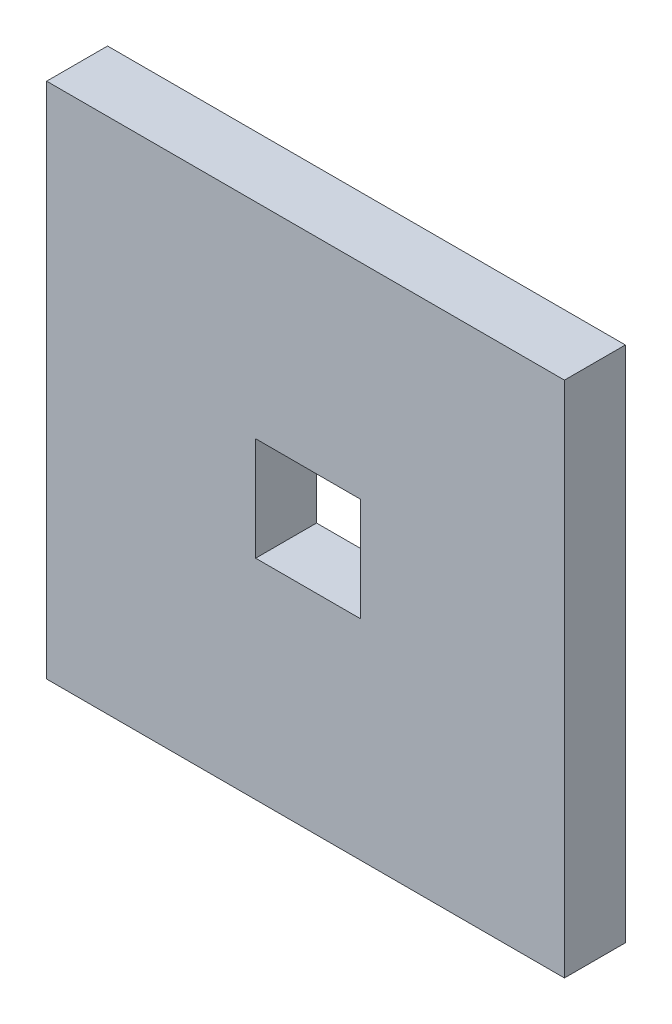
from build123d import *

# Parameters (mm, degrees)
SCHIZZO1_W                        = 60
SCHIZZO1_H                        = 60
SCHIZZO1_W_2                      = 21.49
SCHIZZO1_H_2                      = 21.490369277
ESTRUSIONE_ESTRUSIONE1_DEPTH      = 3
ESTRUSIONE_ESTRUSIONE2_DEPTH      = 3
ESTRUSIONE_ESTRUSIONE2_DEPTH_BACK = 5
SCHIZZO1_2_W                      = 21.49
SCHIZZO1_2_H                      = 21.490369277
ESTRUSIONE_ESTRUSIONE6_DEPTH      = 1
ESTRUSIONE_ESTRUSIONE7_DEPTH      = 0.29
ESTRUSIONE_ESTRUSIONE8_DEPTH      = 0.71
ESTRUSIONE_ESTRUSIONE9_DEPTH      = 5
ESTRUSIONE_ESTRUSIONE10_DEPTH     = 5
SCHIZZO5_W                        = 68
SCHIZZO5_H                        = 68
SCHIZZO5_W_2                      = 60
SCHIZZO5_H_2                      = 60
ESTRUSIONE_ESTRUSIONE11_DEPTH     = 8
SCHIZZO6_W                        = 2
SCHIZZO6_H                        = 5
SCHIZZO6_W_2                      = 5
SCHIZZO6_H_2                      = 2
TAGLIO_ESTRUSIONE2_DEPTH          = 4.71
RACCORDO2_R                       = 2
RACCORDO3_R                       = 2
SCHIZZO6_3_W                      = 2
SCHIZZO6_3_H                      = 5
SCHIZZO6_3_W_2                    = 5
SCHIZZO6_3_H_2                    = 2
TAGLIO_ESTRUSIONE3_DEPTH          = 5
RACCORDO4_R                       = 2
TAGLIO_ESTRUSIONE4_REACH          = 90.147
SCHIZZO7_W                        = 13.762462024
SCHIZZO7_H                        = 13.591548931


with BuildPart() as part:
    # Schizzo1 → Estrusione-Estrusione1 (new body)
    with BuildSketch(Plane.XY):
        with Locations((-45.450351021, 3.330286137)):
            Rectangle(SCHIZZO1_W, SCHIZZO1_H)
        with Locations((-45.135262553, 3.531830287)):
            Rectangle(SCHIZZO1_W_2, SCHIZZO1_H_2, mode=Mode.SUBTRACT)
    extrude(amount=ESTRUSIONE_ESTRUSIONE1_DEPTH)

    # Schizzo1_2 → Estrusione-Estrusione2 (add, two sides: drawn at the far end of the back side and taken through both)
    with BuildSketch(Plane.XY.offset(-ESTRUSIONE_ESTRUSIONE2_DEPTH_BACK)):
        with Locations((-45.135262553, 3.531830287)):
            Rectangle(SCHIZZO1_2_W, SCHIZZO1_2_H)
    extrude(amount=ESTRUSIONE_ESTRUSIONE2_DEPTH + ESTRUSIONE_ESTRUSIONE2_DEPTH_BACK)

    # Schizzo2 → Estrusione-Estrusione6 (add)
    with BuildSketch(Plane(origin=(0, 0, 0), x_dir=(-1, 0, 0), z_dir=(0, 0, -1))):
        with BuildLine():
            Line((38.412386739, 33.330286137), (51.967458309, 14.682391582))
            ThreePointArc((51.967458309, 14.682391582), (52.880147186, 15.275785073), (53.792973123, 14.682602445))
            Line((53.792973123, 14.682602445), (67.341308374, 33.330286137))
            Line((67.341308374, 33.330286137), (66.105240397, 33.330286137))
            Line((66.105240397, 33.330286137), (66.103526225, 33.327926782))
            Line((66.103526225, 33.327926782), (53.380262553, 15.815856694))
            Line((53.380262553, 15.815856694), (53.380262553, 33.330286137))
            Line((53.380262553, 33.330286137), (52.380262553, 33.330286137))
            Line((52.380262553, 33.330286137), (52.380262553, 15.808601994))
            Line((52.380262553, 15.808601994), (39.64382832, 33.330286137))
            Line((39.64382832, 33.330286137), (38.412386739, 33.330286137))
        make_face()
    extrude(amount=ESTRUSIONE_ESTRUSIONE6_DEPTH)

    # Schizzo4 → Estrusione-Estrusione7 (add)
    with BuildSketch(Plane(origin=(0, 0, 0), x_dir=(-1, 0, 0), z_dir=(0, 0, -1))):
        Polygon((34.390262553, 14.277014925), (34.390262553, 33.330286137), (15.450351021, 33.330286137), (15.450351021, -26.669713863), (34.390262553, -26.669713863), (34.390262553, -7.213354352), align=None)
    extrude(amount=ESTRUSIONE_ESTRUSIONE7_DEPTH)

    # Schizzo2_8 → Estrusione-Estrusione8 (add)
    with BuildSketch(Plane(origin=(0, 0, 0), x_dir=(-1, 0, 0), z_dir=(0, 0, -1))):
        with BuildLine():
            ThreePointArc((33.416058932, -2.823354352), (33.393682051, -2.613354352), (33.416058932, -2.403354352))
            Line((33.416058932, -2.403354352), (15.450351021, -2.403354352))
            Line((15.450351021, -2.403354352), (15.450351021, -2.823354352))
            Line((15.450351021, -2.823354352), (33.416058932, -2.823354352))
        make_face()
    extrude(amount=ESTRUSIONE_ESTRUSIONE8_DEPTH)

    # Schizzo2_9 → Estrusione-Estrusione9 (add)
    with BuildSketch(Plane(origin=(0, 0, 0), x_dir=(-1, 0, 0), z_dir=(0, 0, -1))):
        with BuildLine():
            ThreePointArc((53.879032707, 14.277014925), (52.880262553, 15.27578508), (51.881492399, 14.277014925))
            Line((51.881492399, 14.277014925), (53.879032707, 14.277014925))
        make_face()
    extrude(amount=ESTRUSIONE_ESTRUSIONE9_DEPTH)

    # Schizzo2_10 → Estrusione-Estrusione10 (add)
    with BuildSketch(Plane(origin=(0, 0, 0), x_dir=(-1, 0, 0), z_dir=(0, 0, -1))):
        with BuildLine():
            Line((34.390262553, -2.403354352), (34.390262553, -1.616773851))
            ThreePointArc((34.390262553, -1.616773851), (33.764207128, -1.837965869), (33.416058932, -2.403354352))
            Line((33.416058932, -2.403354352), (34.390262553, -2.403354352))
        make_face()
        with BuildLine():
            Line((34.390262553, -2.823354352), (34.390262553, -2.403354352))
            Line((34.390262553, -2.403354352), (33.416058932, -2.403354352))
            ThreePointArc((33.416058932, -2.403354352), (33.393682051, -2.613354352), (33.416058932, -2.823354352))
            Line((33.416058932, -2.823354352), (34.390262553, -2.823354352))
        make_face()
        with BuildLine():
            Line((34.390262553, -3.609934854), (34.390262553, -2.823354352))
            Line((34.390262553, -2.823354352), (33.416058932, -2.823354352))
            ThreePointArc((33.416058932, -2.823354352), (33.764207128, -3.388742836), (34.390262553, -3.609934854))
        make_face()
    extrude(amount=ESTRUSIONE_ESTRUSIONE10_DEPTH)

    # Schizzo5 → Estrusione-Estrusione11 (add)
    with BuildSketch(Plane.XY.offset(3)):
        with Locations((-45.450351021, 3.330286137)):
            Rectangle(SCHIZZO5_W, SCHIZZO5_H)
        with Locations((-45.450351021, 3.330286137)):
            Rectangle(SCHIZZO5_W_2, SCHIZZO5_H_2, mode=Mode.SUBTRACT)
    extrude(amount=-ESTRUSIONE_ESTRUSIONE11_DEPTH)

    # Schizzo6 → Taglio-Estrusione2 (cut)
    with BuildSketch(Plane(origin=(0, 0, -5), x_dir=(-1, 0, 0), z_dir=(0, 0, -1))):
        with Locations((14.450351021, -24.169713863)):
            Rectangle(SCHIZZO6_W, SCHIZZO6_H)
        with Locations((17.950351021, 34.330286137)):
            Rectangle(SCHIZZO6_W_2, SCHIZZO6_H_2)
    extrude(amount=-TAGLIO_ESTRUSIONE2_DEPTH, mode=Mode.SUBTRACT)

    # Raccordo2
    raccordo2_edges = [part.edges().sort_by_distance(p)[0] for p in [
        (-13.450351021, -24.169713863, -0.29),
    ]]
    fillet(raccordo2_edges, radius=RACCORDO2_R)

    # Raccordo3
    raccordo3_edges = [part.edges().sort_by_distance(p)[0] for p in [
        (-17.950351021, 35.330286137, -0.29),
    ]]
    fillet(raccordo3_edges, radius=RACCORDO3_R)

    # Schizzo6_3 → Taglio-Estrusione3 (cut)
    with BuildSketch(Plane(origin=(0, 0, -5), x_dir=(-1, 0, 0), z_dir=(0, 0, -1))):
        with Locations((76.450351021, 30.830286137)):
            Rectangle(SCHIZZO6_3_W, SCHIZZO6_3_H)
        with Locations((72.950351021, -27.669713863)):
            Rectangle(SCHIZZO6_3_W_2, SCHIZZO6_3_H_2)
    extrude(amount=-TAGLIO_ESTRUSIONE3_DEPTH, mode=Mode.SUBTRACT)

    # Raccordo4
    raccordo4_edges = [part.edges().sort_by_distance(p)[0] for p in [
        (-72.950351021, -28.669713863, 0),
        (-77.450351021, 30.830286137, 0),
    ]]
    fillet(raccordo4_edges, radius=RACCORDO4_R)

    # Schizzo7 → Taglio-Estrusione4 (cut, up to next)
    with BuildSketch(Plane(origin=(0, 0, -5), x_dir=(-1, 0, 0), z_dir=(0, 0, -1)), mode=Mode.PRIVATE) as taglio_estrusione4_sk1:
        with Locations((45.123174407, 3.59361052)):
            Rectangle(SCHIZZO7_W, SCHIZZO7_H)
    taglio_estrusione4_tool1 = extrude(taglio_estrusione4_sk1.sketch, amount=-TAGLIO_ESTRUSIONE4_REACH, mode=Mode.PRIVATE) & part.part
    add(taglio_estrusione4_tool1.solids().sort_by_distance((-45.123174, 3.593611, -5))[0], mode=Mode.SUBTRACT)


solid = part.part
